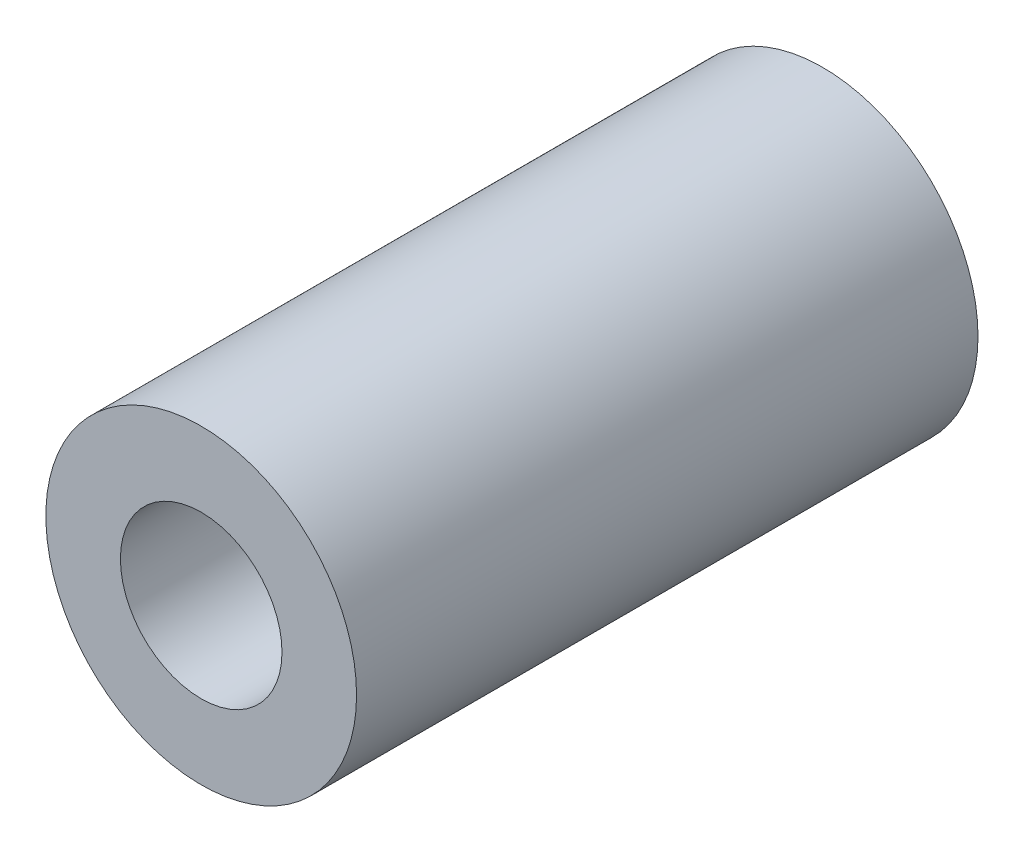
ISO-10303-21;
HEADER;
FILE_DESCRIPTION(('STEP AP214'),'2;1');
FILE_NAME('part.step','',(''),(''),'','','');
FILE_SCHEMA(('AUTOMOTIVE_DESIGN { 1 0 10303 214 1 1 1 1 }'));
ENDSEC;
DATA;
#1=APPLICATION_CONTEXT('core data for automotive mechanical design processes');
#2=APPLICATION_PROTOCOL_DEFINITION('international standard','automotive_design',2000,#1);
#3=PRODUCT_CONTEXT('',#1,'mechanical');
#4=PRODUCT('Part','Part','',(#3));
#5=PRODUCT_RELATED_PRODUCT_CATEGORY('part','',(#4));
#6=PRODUCT_DEFINITION_FORMATION('','',#4);
#7=PRODUCT_DEFINITION_CONTEXT('part definition',#1,'design');
#8=PRODUCT_DEFINITION('design','',#6,#7);
#9=PRODUCT_DEFINITION_SHAPE('','',#8);
#10=(LENGTH_UNIT() NAMED_UNIT(*) SI_UNIT(.MILLI.,.METRE.));
#11=(NAMED_UNIT(*) PLANE_ANGLE_UNIT() SI_UNIT($,.RADIAN.));
#12=(NAMED_UNIT(*) SI_UNIT($,.STERADIAN.) SOLID_ANGLE_UNIT());
#13=UNCERTAINTY_MEASURE_WITH_UNIT(LENGTH_MEASURE(1.E-05),#10,'distance_accuracy_value','');
#14=(GEOMETRIC_REPRESENTATION_CONTEXT(3) GLOBAL_UNCERTAINTY_ASSIGNED_CONTEXT((#13)) GLOBAL_UNIT_ASSIGNED_CONTEXT((#10,
#11,#12)) REPRESENTATION_CONTEXT('',''));
#15=CARTESIAN_POINT('',(0.,0.,0.));
#16=DIRECTION('',(0.,0.,1.));
#17=DIRECTION('',(1.,0.,0.));
#18=AXIS2_PLACEMENT_3D('',#15,#16,#17);
#19=CARTESIAN_POINT('',(0.,0.,40.));
#20=DIRECTION('',(0.,0.,1.));
#21=DIRECTION('',(1.,0.,0.));
#22=AXIS2_PLACEMENT_3D('',#19,#20,#21);
#23=CYLINDRICAL_SURFACE('',#22,8.);
#24=CARTESIAN_POINT('',(0.,0.,0.));
#25=DIRECTION('',(0.,0.,1.));
#26=DIRECTION('',(1.,0.,0.));
#27=AXIS2_PLACEMENT_3D('',#24,#25,#26);
#28=CIRCLE('',#27,8.);
#29=CARTESIAN_POINT('',(8.,0.,0.));
#30=VERTEX_POINT('',#29);
#31=EDGE_CURVE('E8',#30,#30,#28,.T.);
#32=ORIENTED_EDGE('',*,*,#31,.F.);
#33=EDGE_LOOP('',(#32));
#34=FACE_BOUND('',#33,.T.);
#35=CARTESIAN_POINT('',(0.,0.,25.));
#36=DIRECTION('',(0.,0.,1.));
#37=DIRECTION('',(1.,0.,0.));
#38=AXIS2_PLACEMENT_3D('',#35,#36,#37);
#39=CIRCLE('',#38,8.);
#40=CARTESIAN_POINT('',(8.,0.,25.));
#41=VERTEX_POINT('',#40);
#42=EDGE_CURVE('E34',#41,#41,#39,.T.);
#43=ORIENTED_EDGE('',*,*,#42,.T.);
#44=EDGE_LOOP('',(#43));
#45=FACE_BOUND('',#44,.T.);
#46=ADVANCED_FACE('F12',(#34,#45),#23,.F.);
#47=CARTESIAN_POINT('',(8.,0.,0.));
#48=DIRECTION('',(0.,0.,1.));
#49=DIRECTION('',(1.,0.,0.));
#50=AXIS2_PLACEMENT_3D('',#47,#48,#49);
#51=PLANE('',#50);
#52=CARTESIAN_POINT('',(0.,0.,0.));
#53=DIRECTION('',(0.,0.,1.));
#54=DIRECTION('',(1.,0.,0.));
#55=AXIS2_PLACEMENT_3D('',#52,#53,#54);
#56=CIRCLE('',#55,25.);
#57=CARTESIAN_POINT('',(25.,0.,0.));
#58=VERTEX_POINT('',#57);
#59=EDGE_CURVE('E18',#58,#58,#56,.T.);
#60=ORIENTED_EDGE('',*,*,#59,.F.);
#61=EDGE_LOOP('',(#60));
#62=FACE_BOUND('',#61,.T.);
#63=ORIENTED_EDGE('',*,*,#31,.T.);
#64=EDGE_LOOP('',(#63));
#65=FACE_BOUND('',#64,.T.);
#66=ADVANCED_FACE('F59',(#62,#65),#51,.F.);
#67=CARTESIAN_POINT('',(0.,0.,40.));
#68=DIRECTION('',(0.,0.,1.));
#69=DIRECTION('',(1.,0.,0.));
#70=AXIS2_PLACEMENT_3D('',#67,#68,#69);
#71=CYLINDRICAL_SURFACE('',#70,25.);
#72=CARTESIAN_POINT('',(0.,0.,100.));
#73=DIRECTION('',(0.,0.,1.));
#74=DIRECTION('',(1.,0.,0.));
#75=AXIS2_PLACEMENT_3D('',#72,#73,#74);
#76=CIRCLE('',#75,25.);
#77=CARTESIAN_POINT('',(25.,0.,100.));
#78=VERTEX_POINT('',#77);
#79=EDGE_CURVE('E22',#78,#78,#76,.T.);
#80=ORIENTED_EDGE('',*,*,#79,.F.);
#81=EDGE_LOOP('',(#80));
#82=FACE_BOUND('',#81,.T.);
#83=ORIENTED_EDGE('',*,*,#59,.T.);
#84=EDGE_LOOP('',(#83));
#85=FACE_BOUND('',#84,.T.);
#86=ADVANCED_FACE('F54',(#82,#85),#71,.T.);
#87=CARTESIAN_POINT('',(25.,0.,100.));
#88=DIRECTION('',(0.,0.,-1.));
#89=DIRECTION('',(-1.,0.,0.));
#90=AXIS2_PLACEMENT_3D('',#87,#88,#89);
#91=PLANE('',#90);
#92=CARTESIAN_POINT('',(0.,0.,100.));
#93=DIRECTION('',(0.,0.,1.));
#94=DIRECTION('',(1.,0.,0.));
#95=AXIS2_PLACEMENT_3D('',#92,#93,#94);
#96=CIRCLE('',#95,13.);
#97=CARTESIAN_POINT('',(13.,0.,100.));
#98=VERTEX_POINT('',#97);
#99=EDGE_CURVE('E26',#98,#98,#96,.T.);
#100=ORIENTED_EDGE('',*,*,#99,.F.);
#101=EDGE_LOOP('',(#100));
#102=FACE_BOUND('',#101,.T.);
#103=ORIENTED_EDGE('',*,*,#79,.T.);
#104=EDGE_LOOP('',(#103));
#105=FACE_BOUND('',#104,.T.);
#106=ADVANCED_FACE('F48',(#102,#105),#91,.F.);
#107=CARTESIAN_POINT('',(0.,0.,40.));
#108=DIRECTION('',(0.,0.,1.));
#109=DIRECTION('',(1.,0.,0.));
#110=AXIS2_PLACEMENT_3D('',#107,#108,#109);
#111=CYLINDRICAL_SURFACE('',#110,13.);
#112=CARTESIAN_POINT('',(0.,0.,25.));
#113=DIRECTION('',(0.,0.,1.));
#114=DIRECTION('',(1.,0.,0.));
#115=AXIS2_PLACEMENT_3D('',#112,#113,#114);
#116=CIRCLE('',#115,13.);
#117=CARTESIAN_POINT('',(13.,0.,25.));
#118=VERTEX_POINT('',#117);
#119=EDGE_CURVE('E31',#118,#118,#116,.T.);
#120=ORIENTED_EDGE('',*,*,#119,.F.);
#121=EDGE_LOOP('',(#120));
#122=FACE_BOUND('',#121,.T.);
#123=ORIENTED_EDGE('',*,*,#99,.T.);
#124=EDGE_LOOP('',(#123));
#125=FACE_BOUND('',#124,.T.);
#126=ADVANCED_FACE('F42',(#122,#125),#111,.F.);
#127=CARTESIAN_POINT('',(13.,0.,25.));
#128=DIRECTION('',(0.,0.,-1.));
#129=DIRECTION('',(-1.,0.,0.));
#130=AXIS2_PLACEMENT_3D('',#127,#128,#129);
#131=PLANE('',#130);
#132=ORIENTED_EDGE('',*,*,#42,.F.);
#133=EDGE_LOOP('',(#132));
#134=FACE_BOUND('',#133,.T.);
#135=ORIENTED_EDGE('',*,*,#119,.T.);
#136=EDGE_LOOP('',(#135));
#137=FACE_BOUND('',#136,.T.);
#138=ADVANCED_FACE('F39',(#134,#137),#131,.F.);
#139=CLOSED_SHELL('',(#46,#66,#86,#106,#126,#138));
#140=MANIFOLD_SOLID_BREP('B1',#139);
#141=ADVANCED_BREP_SHAPE_REPRESENTATION('',(#18,#140),#14);
#142=SHAPE_DEFINITION_REPRESENTATION(#9,#141);
ENDSEC;
END-ISO-10303-21;
